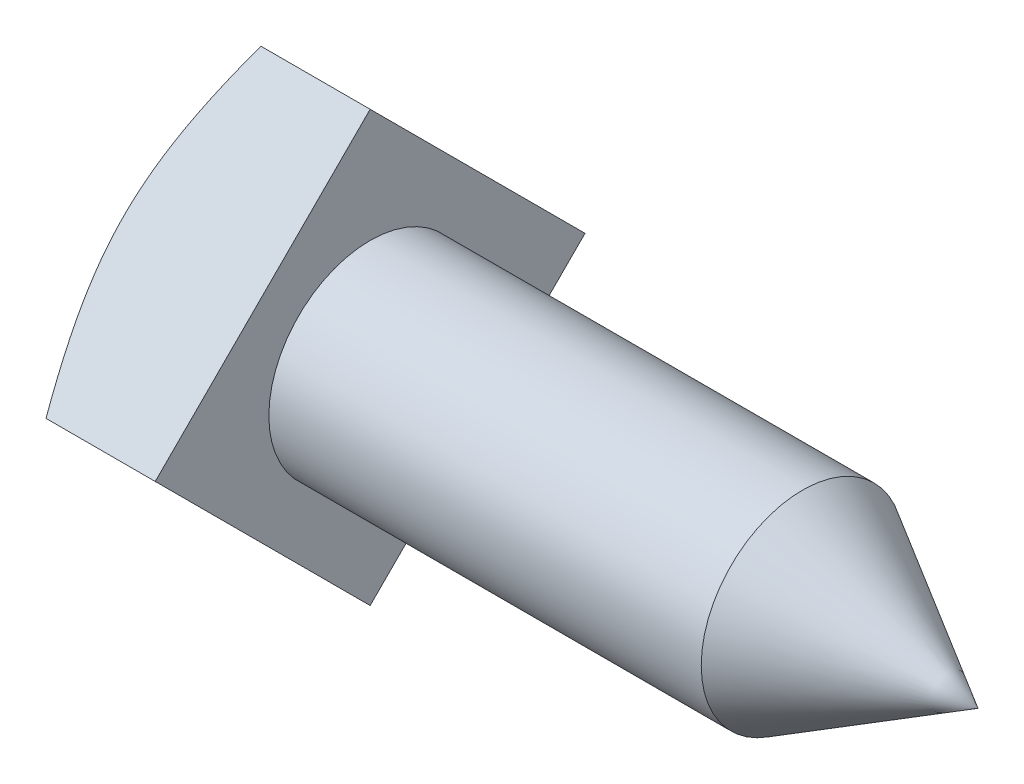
from build123d import *

# Parameters (mm, degrees)
SKETCH1_W      = 38.1
SKETCH1_H      = 38.1
BASEHEAD_DEPTH = 17.3736


with BuildPart() as part:
    # Sketch1 → BaseHead (new body)
    with BuildSketch(Plane(origin=(0, 0, 0), x_dir=(0, 0.7071067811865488, -0.7071067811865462), z_dir=(1, 0, 0))):
        Rectangle(SKETCH1_W, SKETCH1_H)
    extrude(amount=BASEHEAD_DEPTH)

    # Sketch2 → Body (revolve)
    with BuildSketch(Plane.XY, mode=Mode.PRIVATE) as body_sk:
        Polygon((17.3736, 0), (17.3736, 12.7), (71.576554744, 12.7), (93.5736, 0), align=None)
    revolve(body_sk.sketch.rotate(Axis((0, 0, 0), (1, 0, 0)), 90), axis=Axis((0, 0, 0), (1, 0, 0)))

    # Sketch3 → HeadChamfer (revolve, cut)
    with BuildSketch(Plane.XY):
        Polygon((0, 19.05), (-12.7, 19.05), (-12.7, 52.340768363), (15.523740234, 52.340768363), align=None)
    revolve(axis=Axis((0, 0, 0), (1, 0, 0)), mode=Mode.SUBTRACT)


solid = part.part
